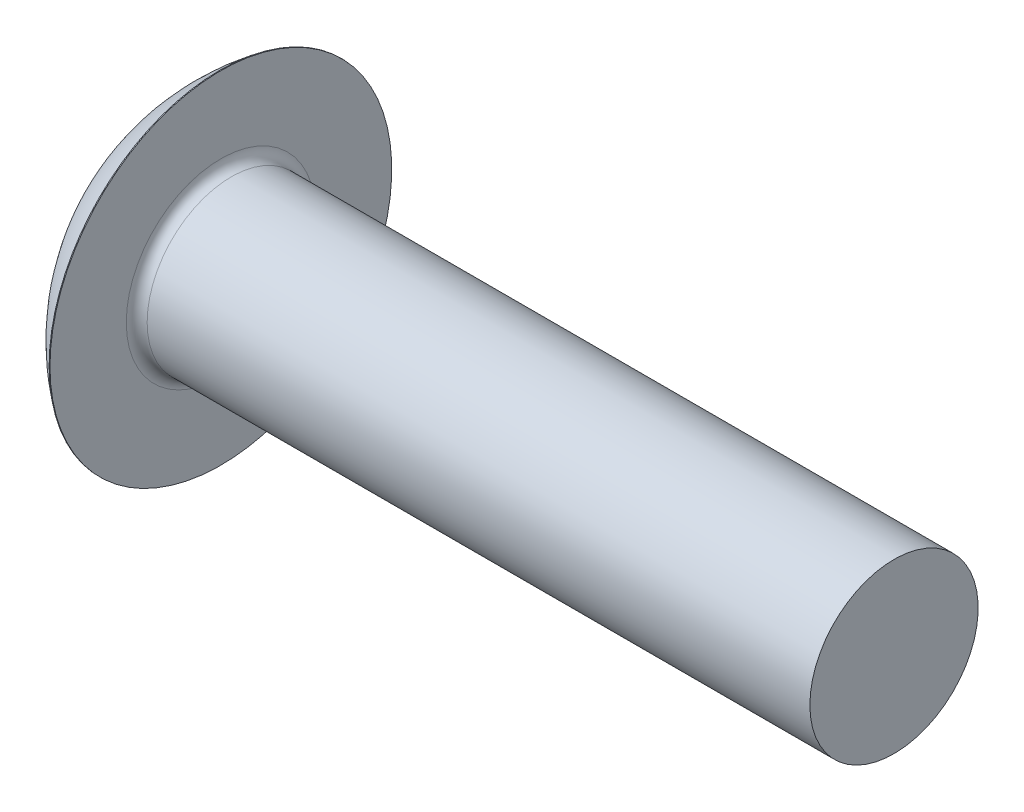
ISO-10303-21;
HEADER;
FILE_DESCRIPTION(('STEP AP214'),'2;1');
FILE_NAME('part.step','',(''),(''),'','','');
FILE_SCHEMA(('AUTOMOTIVE_DESIGN { 1 0 10303 214 1 1 1 1 }'));
ENDSEC;
DATA;
#1=APPLICATION_CONTEXT('core data for automotive mechanical design processes');
#2=APPLICATION_PROTOCOL_DEFINITION('international standard','automotive_design',2000,#1);
#3=PRODUCT_CONTEXT('',#1,'mechanical');
#4=PRODUCT('Part','Part','',(#3));
#5=PRODUCT_RELATED_PRODUCT_CATEGORY('part','',(#4));
#6=PRODUCT_DEFINITION_FORMATION('','',#4);
#7=PRODUCT_DEFINITION_CONTEXT('part definition',#1,'design');
#8=PRODUCT_DEFINITION('design','',#6,#7);
#9=PRODUCT_DEFINITION_SHAPE('','',#8);
#10=(LENGTH_UNIT() NAMED_UNIT(*) SI_UNIT(.MILLI.,.METRE.));
#11=(NAMED_UNIT(*) PLANE_ANGLE_UNIT() SI_UNIT($,.RADIAN.));
#12=(NAMED_UNIT(*) SI_UNIT($,.STERADIAN.) SOLID_ANGLE_UNIT());
#13=UNCERTAINTY_MEASURE_WITH_UNIT(LENGTH_MEASURE(1.E-05),#10,'distance_accuracy_value','');
#14=(GEOMETRIC_REPRESENTATION_CONTEXT(3) GLOBAL_UNCERTAINTY_ASSIGNED_CONTEXT((#13)) GLOBAL_UNIT_ASSIGNED_CONTEXT((#10,
#11,#12)) REPRESENTATION_CONTEXT('',''));
#15=CARTESIAN_POINT('',(0.,0.,0.));
#16=DIRECTION('',(0.,0.,1.));
#17=DIRECTION('',(1.,0.,0.));
#18=AXIS2_PLACEMENT_3D('',#15,#16,#17);
#19=CARTESIAN_POINT('',(32.1193500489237,0.,0.));
#20=DIRECTION('',(-1.,0.,0.));
#21=DIRECTION('',(0.,1.,0.));
#22=AXIS2_PLACEMENT_3D('',#19,#20,#21);
#23=SPHERICAL_SURFACE('',#22,32.1193500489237);
#24=CARTESIAN_POINT('',(12.9794,0.,0.));
#25=DIRECTION('',(-1.,0.,0.));
#26=DIRECTION('',(0.,0.,1.));
#27=AXIS2_PLACEMENT_3D('',#24,#25,#26);
#28=CIRCLE('',#27,25.7937);
#29=CARTESIAN_POINT('',(12.9794,0.,25.7937));
#30=VERTEX_POINT('',#29);
#31=EDGE_CURVE('E56',#30,#30,#28,.T.);
#32=ORIENTED_EDGE('',*,*,#31,.T.);
#33=EDGE_LOOP('',(#32));
#34=FACE_BOUND('',#33,.T.);
#35=ADVANCED_FACE('F37',(#34),#23,.T.);
#36=CARTESIAN_POINT('',(114.7064,12.7,0.));
#37=DIRECTION('',(1.,0.,0.));
#38=DIRECTION('',(0.,0.,-1.));
#39=AXIS2_PLACEMENT_3D('',#36,#37,#38);
#40=PLANE('',#39);
#41=CARTESIAN_POINT('',(114.7064,0.,0.));
#42=DIRECTION('',(-1.,0.,0.));
#43=DIRECTION('',(0.,0.,1.));
#44=AXIS2_PLACEMENT_3D('',#41,#42,#43);
#45=CIRCLE('',#44,12.7);
#46=CARTESIAN_POINT('',(114.7064,0.,12.7));
#47=VERTEX_POINT('',#46);
#48=EDGE_CURVE('E10',#47,#47,#45,.T.);
#49=ORIENTED_EDGE('',*,*,#48,.F.);
#50=EDGE_LOOP('',(#49));
#51=FACE_BOUND('',#50,.T.);
#52=ADVANCED_FACE('F79',(#51),#40,.T.);
#53=CARTESIAN_POINT('',(0.,0.,0.));
#54=DIRECTION('',(-1.,0.,0.));
#55=DIRECTION('',(0.,0.,1.));
#56=AXIS2_PLACEMENT_3D('',#53,#54,#55);
#57=CYLINDRICAL_SURFACE('',#56,12.7);
#58=ORIENTED_EDGE('',*,*,#48,.T.);
#59=EDGE_LOOP('',(#58));
#60=FACE_BOUND('',#59,.T.);
#61=CARTESIAN_POINT('',(14.6812,0.,0.));
#62=DIRECTION('',(-1.,0.,0.));
#63=DIRECTION('',(0.,0.,1.));
#64=AXIS2_PLACEMENT_3D('',#61,#62,#63);
#65=CIRCLE('',#64,12.7);
#66=CARTESIAN_POINT('',(14.6812,0.,12.7));
#67=VERTEX_POINT('',#66);
#68=EDGE_CURVE('E43',#67,#67,#65,.T.);
#69=ORIENTED_EDGE('',*,*,#68,.F.);
#70=EDGE_LOOP('',(#69));
#71=FACE_BOUND('',#70,.T.);
#72=ADVANCED_FACE('F75',(#60,#71),#57,.T.);
#73=CARTESIAN_POINT('',(14.6812,0.,0.));
#74=DIRECTION('',(-1.,0.,0.));
#75=DIRECTION('',(0.,0.,1.));
#76=AXIS2_PLACEMENT_3D('',#73,#74,#75);
#77=TOROIDAL_SURFACE('',#76,14.2748,1.5748);
#78=CARTESIAN_POINT('',(13.1064,0.,0.));
#79=DIRECTION('',(-1.,0.,0.));
#80=DIRECTION('',(0.,0.,1.));
#81=AXIS2_PLACEMENT_3D('',#78,#79,#80);
#82=CIRCLE('',#81,14.2748);
#83=CARTESIAN_POINT('',(13.1064,0.,14.2748));
#84=VERTEX_POINT('',#83);
#85=EDGE_CURVE('E47',#84,#84,#82,.T.);
#86=ORIENTED_EDGE('',*,*,#85,.F.);
#87=EDGE_LOOP('',(#86));
#88=FACE_BOUND('',#87,.T.);
#89=ORIENTED_EDGE('',*,*,#68,.T.);
#90=EDGE_LOOP('',(#89));
#91=FACE_BOUND('',#90,.T.);
#92=ADVANCED_FACE('F69',(#88,#91),#77,.F.);
#93=CARTESIAN_POINT('',(13.1064,25.7937,0.));
#94=DIRECTION('',(1.,0.,0.));
#95=DIRECTION('',(0.,0.,-1.));
#96=AXIS2_PLACEMENT_3D('',#93,#94,#95);
#97=PLANE('',#96);
#98=ORIENTED_EDGE('',*,*,#85,.T.);
#99=EDGE_LOOP('',(#98));
#100=FACE_BOUND('',#99,.T.);
#101=CARTESIAN_POINT('',(13.1064,0.,0.));
#102=DIRECTION('',(-1.,0.,0.));
#103=DIRECTION('',(0.,0.,1.));
#104=AXIS2_PLACEMENT_3D('',#101,#102,#103);
#105=CIRCLE('',#104,25.7937);
#106=CARTESIAN_POINT('',(13.1064,0.,25.7937));
#107=VERTEX_POINT('',#106);
#108=EDGE_CURVE('E51',#107,#107,#105,.T.);
#109=ORIENTED_EDGE('',*,*,#108,.F.);
#110=EDGE_LOOP('',(#109));
#111=FACE_BOUND('',#110,.T.);
#112=ADVANCED_FACE('F64',(#100,#111),#97,.T.);
#113=CARTESIAN_POINT('',(0.,0.,0.));
#114=DIRECTION('',(-1.,0.,0.));
#115=DIRECTION('',(0.,0.,1.));
#116=AXIS2_PLACEMENT_3D('',#113,#114,#115);
#117=CYLINDRICAL_SURFACE('',#116,25.7937);
#118=ORIENTED_EDGE('',*,*,#31,.F.);
#119=EDGE_LOOP('',(#118));
#120=FACE_BOUND('',#119,.T.);
#121=ORIENTED_EDGE('',*,*,#108,.T.);
#122=EDGE_LOOP('',(#121));
#123=FACE_BOUND('',#122,.T.);
#124=ADVANCED_FACE('F61',(#120,#123),#117,.T.);
#125=CLOSED_SHELL('',(#35,#52,#72,#92,#112,#124));
#126=MANIFOLD_SOLID_BREP('B2',#125);
#127=ADVANCED_BREP_SHAPE_REPRESENTATION('',(#18,#126),#14);
#128=SHAPE_DEFINITION_REPRESENTATION(#9,#127);
ENDSEC;
END-ISO-10303-21;
